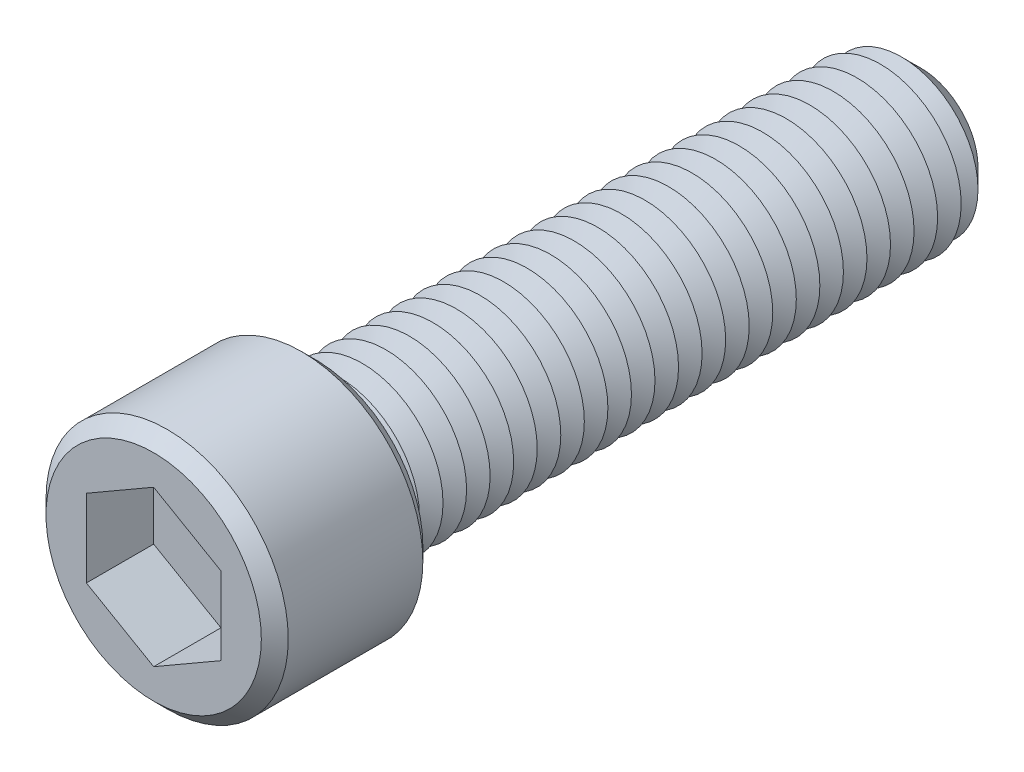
ISO-10303-21;
HEADER;
FILE_DESCRIPTION(('STEP AP214'),'2;1');
FILE_NAME('part.step','',(''),(''),'','','');
FILE_SCHEMA(('AUTOMOTIVE_DESIGN { 1 0 10303 214 1 1 1 1 }'));
ENDSEC;
DATA;
#1=APPLICATION_CONTEXT('core data for automotive mechanical design processes');
#2=APPLICATION_PROTOCOL_DEFINITION('international standard','automotive_design',2000,#1);
#3=PRODUCT_CONTEXT('',#1,'mechanical');
#4=PRODUCT('Part','Part','',(#3));
#5=PRODUCT_RELATED_PRODUCT_CATEGORY('part','',(#4));
#6=PRODUCT_DEFINITION_FORMATION('','',#4);
#7=PRODUCT_DEFINITION_CONTEXT('part definition',#1,'design');
#8=PRODUCT_DEFINITION('design','',#6,#7);
#9=PRODUCT_DEFINITION_SHAPE('','',#8);
#10=(LENGTH_UNIT() NAMED_UNIT(*) SI_UNIT(.MILLI.,.METRE.));
#11=(NAMED_UNIT(*) PLANE_ANGLE_UNIT() SI_UNIT($,.RADIAN.));
#12=(NAMED_UNIT(*) SI_UNIT($,.STERADIAN.) SOLID_ANGLE_UNIT());
#13=UNCERTAINTY_MEASURE_WITH_UNIT(LENGTH_MEASURE(1.E-05),#10,'distance_accuracy_value','');
#14=(GEOMETRIC_REPRESENTATION_CONTEXT(3) GLOBAL_UNCERTAINTY_ASSIGNED_CONTEXT((#13)) GLOBAL_UNIT_ASSIGNED_CONTEXT((#10,
#11,#12)) REPRESENTATION_CONTEXT('',''));
#15=CARTESIAN_POINT('',(0.,0.,0.));
#16=DIRECTION('',(0.,0.,1.));
#17=DIRECTION('',(1.,0.,0.));
#18=AXIS2_PLACEMENT_3D('',#15,#16,#17);
#19=CARTESIAN_POINT('',(0.,0.,12.));
#20=DIRECTION('',(0.,0.,-1.));
#21=DIRECTION('',(-1.,0.,0.));
#22=AXIS2_PLACEMENT_3D('',#19,#20,#21);
#23=CYLINDRICAL_SURFACE('',#22,9.);
#24=CARTESIAN_POINT('',(0.,0.,0.999999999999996));
#25=DIRECTION('',(0.,0.,1.));
#26=DIRECTION('',(1.,0.,0.));
#27=AXIS2_PLACEMENT_3D('',#24,#25,#26);
#28=CIRCLE('',#27,9.);
#29=CARTESIAN_POINT('',(9.,0.,0.999999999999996));
#30=VERTEX_POINT('',#29);
#31=EDGE_CURVE('E376',#30,#30,#28,.T.);
#32=ORIENTED_EDGE('',*,*,#31,.T.);
#33=EDGE_LOOP('',(#32));
#34=FACE_BOUND('',#33,.T.);
#35=CARTESIAN_POINT('',(0.,0.,11.));
#36=DIRECTION('',(0.,0.,1.));
#37=DIRECTION('',(1.,0.,0.));
#38=AXIS2_PLACEMENT_3D('',#35,#36,#37);
#39=CIRCLE('',#38,9.);
#40=CARTESIAN_POINT('',(9.,0.,11.));
#41=VERTEX_POINT('',#40);
#42=EDGE_CURVE('E369',#41,#41,#39,.F.);
#43=ORIENTED_EDGE('',*,*,#42,.T.);
#44=EDGE_LOOP('',(#43));
#45=FACE_BOUND('',#44,.T.);
#46=ADVANCED_FACE('F39',(#34,#45),#23,.T.);
#47=CARTESIAN_POINT('',(0.,0.,12.));
#48=DIRECTION('',(0.,0.,1.));
#49=DIRECTION('',(1.,0.,0.));
#50=AXIS2_PLACEMENT_3D('',#47,#48,#49);
#51=PLANE('',#50);
#52=CARTESIAN_POINT('',(0.,0.,12.));
#53=DIRECTION('',(0.,0.,1.));
#54=DIRECTION('',(1.,0.,0.));
#55=AXIS2_PLACEMENT_3D('',#52,#53,#54);
#56=CIRCLE('',#55,7.99999999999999);
#57=CARTESIAN_POINT('',(7.99999999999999,0.,12.));
#58=VERTEX_POINT('',#57);
#59=EDGE_CURVE('E11',#58,#58,#56,.T.);
#60=ORIENTED_EDGE('',*,*,#59,.T.);
#61=EDGE_LOOP('',(#60));
#62=FACE_BOUND('',#61,.T.);
#63=DIRECTION('',(-0.866025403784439,0.5,0.));
#64=VECTOR('',#63,1.);
#65=CARTESIAN_POINT('',(5.,2.88675134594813,12.));
#66=LINE('',#65,#64);
#67=CARTESIAN_POINT('',(5.,2.88675134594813,12.));
#68=VERTEX_POINT('',#67);
#69=CARTESIAN_POINT('',(0.,5.77350269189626,12.));
#70=VERTEX_POINT('',#69);
#71=EDGE_CURVE('E55',#68,#70,#66,.T.);
#72=ORIENTED_EDGE('',*,*,#71,.F.);
#73=DIRECTION('',(0.,1.,0.));
#74=VECTOR('',#73,1.);
#75=CARTESIAN_POINT('',(5.,-2.88675134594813,12.));
#76=LINE('',#75,#74);
#77=CARTESIAN_POINT('',(5.,-2.88675134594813,12.));
#78=VERTEX_POINT('',#77);
#79=EDGE_CURVE('E151',#78,#68,#76,.T.);
#80=ORIENTED_EDGE('',*,*,#79,.F.);
#81=DIRECTION('',(0.866025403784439,0.5,0.));
#82=VECTOR('',#81,1.);
#83=CARTESIAN_POINT('',(0.,-5.77350269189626,12.));
#84=LINE('',#83,#82);
#85=CARTESIAN_POINT('',(0.,-5.77350269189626,12.));
#86=VERTEX_POINT('',#85);
#87=EDGE_CURVE('E148',#86,#78,#84,.T.);
#88=ORIENTED_EDGE('',*,*,#87,.F.);
#89=DIRECTION('',(0.866025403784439,-0.5,0.));
#90=VECTOR('',#89,1.);
#91=CARTESIAN_POINT('',(-5.,-2.88675134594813,12.));
#92=LINE('',#91,#90);
#93=CARTESIAN_POINT('',(-5.,-2.88675134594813,12.));
#94=VERTEX_POINT('',#93);
#95=EDGE_CURVE('E103',#94,#86,#92,.T.);
#96=ORIENTED_EDGE('',*,*,#95,.F.);
#97=DIRECTION('',(0.,-1.,0.));
#98=VECTOR('',#97,1.);
#99=CARTESIAN_POINT('',(-5.,2.88675134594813,12.));
#100=LINE('',#99,#98);
#101=CARTESIAN_POINT('',(-5.,2.88675134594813,12.));
#102=VERTEX_POINT('',#101);
#103=EDGE_CURVE('E142',#102,#94,#100,.T.);
#104=ORIENTED_EDGE('',*,*,#103,.F.);
#105=DIRECTION('',(-0.866025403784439,-0.5,0.));
#106=VECTOR('',#105,1.);
#107=CARTESIAN_POINT('',(0.,5.77350269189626,12.));
#108=LINE('',#107,#106);
#109=EDGE_CURVE('E137',#70,#102,#108,.T.);
#110=ORIENTED_EDGE('',*,*,#109,.F.);
#111=EDGE_LOOP('',(#72,#80,#88,#96,#104,#110));
#112=FACE_BOUND('',#111,.T.);
#113=ADVANCED_FACE('F394',(#62,#112),#51,.T.);
#114=CARTESIAN_POINT('',(0.,0.,0.));
#115=DIRECTION('',(0.,0.,1.));
#116=DIRECTION('',(1.,0.,0.));
#117=AXIS2_PLACEMENT_3D('',#114,#115,#116);
#118=PLANE('',#117);
#119=CARTESIAN_POINT('',(0.,0.,0.));
#120=DIRECTION('',(0.,0.,1.));
#121=DIRECTION('',(1.,0.,0.));
#122=AXIS2_PLACEMENT_3D('',#119,#120,#121);
#123=CIRCLE('',#122,8.);
#124=CARTESIAN_POINT('',(8.,0.,0.));
#125=VERTEX_POINT('',#124);
#126=EDGE_CURVE('E48',#125,#125,#123,.F.);
#127=ORIENTED_EDGE('',*,*,#126,.T.);
#128=EDGE_LOOP('',(#127));
#129=FACE_BOUND('',#128,.T.);
#130=CARTESIAN_POINT('',(0.,0.,0.));
#131=DIRECTION('',(0.,0.,1.));
#132=DIRECTION('',(1.,0.,0.));
#133=AXIS2_PLACEMENT_3D('',#130,#131,#132);
#134=CIRCLE('',#133,6.);
#135=CARTESIAN_POINT('',(6.,0.,0.));
#136=VERTEX_POINT('',#135);
#137=EDGE_CURVE('E361',#136,#136,#134,.T.);
#138=ORIENTED_EDGE('',*,*,#137,.T.);
#139=EDGE_LOOP('',(#138));
#140=FACE_BOUND('',#139,.T.);
#141=ADVANCED_FACE('F383',(#129,#140),#118,.F.);
#142=CARTESIAN_POINT('',(0.,0.,0.));
#143=DIRECTION('',(0.,0.,1.));
#144=DIRECTION('',(1.,0.,0.));
#145=AXIS2_PLACEMENT_3D('',#142,#143,#144);
#146=CONICAL_SURFACE('',#145,6.,1.0471975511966);
#147=CARTESIAN_POINT('',(0.,0.,-0.875));
#148=DIRECTION('',(0.,0.,1.));
#149=DIRECTION('',(1.,0.,0.));
#150=AXIS2_PLACEMENT_3D('',#147,#148,#149);
#151=CIRCLE('',#150,4.48445554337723);
#152=CARTESIAN_POINT('',(4.48445554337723,0.,-0.875));
#153=VERTEX_POINT('',#152);
#154=EDGE_CURVE('E358',#153,#153,#151,.T.);
#155=ORIENTED_EDGE('',*,*,#154,.T.);
#156=EDGE_LOOP('',(#155));
#157=FACE_BOUND('',#156,.T.);
#158=ORIENTED_EDGE('',*,*,#137,.F.);
#159=EDGE_LOOP('',(#158));
#160=FACE_BOUND('',#159,.T.);
#161=ADVANCED_FACE('F644',(#157,#160),#146,.T.);
#162=CARTESIAN_POINT('',(0.,0.,-0.875));
#163=DIRECTION('',(0.,0.,-1.));
#164=DIRECTION('',(-1.,0.,0.));
#165=AXIS2_PLACEMENT_3D('',#162,#163,#164);
#166=CONICAL_SURFACE('',#165,4.48445554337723,1.0471975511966);
#167=CARTESIAN_POINT('',(0.,0.,-1.75));
#168=DIRECTION('',(0.,0.,1.));
#169=DIRECTION('',(1.,0.,0.));
#170=AXIS2_PLACEMENT_3D('',#167,#168,#169);
#171=CIRCLE('',#170,6.);
#172=CARTESIAN_POINT('',(6.,0.,-1.75));
#173=VERTEX_POINT('',#172);
#174=EDGE_CURVE('E354',#173,#173,#171,.T.);
#175=ORIENTED_EDGE('',*,*,#174,.T.);
#176=EDGE_LOOP('',(#175));
#177=FACE_BOUND('',#176,.T.);
#178=ORIENTED_EDGE('',*,*,#154,.F.);
#179=EDGE_LOOP('',(#178));
#180=FACE_BOUND('',#179,.T.);
#181=ADVANCED_FACE('F640',(#177,#180),#166,.T.);
#182=CARTESIAN_POINT('',(0.,0.,-1.75));
#183=DIRECTION('',(0.,0.,1.));
#184=DIRECTION('',(1.,0.,0.));
#185=AXIS2_PLACEMENT_3D('',#182,#183,#184);
#186=CONICAL_SURFACE('',#185,6.,1.0471975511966);
#187=CARTESIAN_POINT('',(0.,0.,-2.625));
#188=DIRECTION('',(0.,0.,1.));
#189=DIRECTION('',(1.,0.,0.));
#190=AXIS2_PLACEMENT_3D('',#187,#188,#189);
#191=CIRCLE('',#190,4.48445554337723);
#192=CARTESIAN_POINT('',(4.48445554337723,0.,-2.625));
#193=VERTEX_POINT('',#192);
#194=EDGE_CURVE('E350',#193,#193,#191,.T.);
#195=ORIENTED_EDGE('',*,*,#194,.T.);
#196=EDGE_LOOP('',(#195));
#197=FACE_BOUND('',#196,.T.);
#198=ORIENTED_EDGE('',*,*,#174,.F.);
#199=EDGE_LOOP('',(#198));
#200=FACE_BOUND('',#199,.T.);
#201=ADVANCED_FACE('F636',(#197,#200),#186,.T.);
#202=CARTESIAN_POINT('',(0.,0.,-2.625));
#203=DIRECTION('',(0.,0.,-1.));
#204=DIRECTION('',(-1.,0.,0.));
#205=AXIS2_PLACEMENT_3D('',#202,#203,#204);
#206=CONICAL_SURFACE('',#205,4.48445554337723,1.0471975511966);
#207=CARTESIAN_POINT('',(0.,0.,-3.5));
#208=DIRECTION('',(0.,0.,1.));
#209=DIRECTION('',(1.,0.,0.));
#210=AXIS2_PLACEMENT_3D('',#207,#208,#209);
#211=CIRCLE('',#210,6.);
#212=CARTESIAN_POINT('',(6.,0.,-3.5));
#213=VERTEX_POINT('',#212);
#214=EDGE_CURVE('E346',#213,#213,#211,.T.);
#215=ORIENTED_EDGE('',*,*,#214,.T.);
#216=EDGE_LOOP('',(#215));
#217=FACE_BOUND('',#216,.T.);
#218=ORIENTED_EDGE('',*,*,#194,.F.);
#219=EDGE_LOOP('',(#218));
#220=FACE_BOUND('',#219,.T.);
#221=ADVANCED_FACE('F632',(#217,#220),#206,.T.);
#222=CARTESIAN_POINT('',(0.,0.,-3.5));
#223=DIRECTION('',(0.,0.,1.));
#224=DIRECTION('',(1.,0.,0.));
#225=AXIS2_PLACEMENT_3D('',#222,#223,#224);
#226=CONICAL_SURFACE('',#225,6.,1.0471975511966);
#227=CARTESIAN_POINT('',(0.,0.,-4.375));
#228=DIRECTION('',(0.,0.,1.));
#229=DIRECTION('',(1.,0.,0.));
#230=AXIS2_PLACEMENT_3D('',#227,#228,#229);
#231=CIRCLE('',#230,4.48445554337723);
#232=CARTESIAN_POINT('',(4.48445554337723,0.,-4.375));
#233=VERTEX_POINT('',#232);
#234=EDGE_CURVE('E342',#233,#233,#231,.T.);
#235=ORIENTED_EDGE('',*,*,#234,.T.);
#236=EDGE_LOOP('',(#235));
#237=FACE_BOUND('',#236,.T.);
#238=ORIENTED_EDGE('',*,*,#214,.F.);
#239=EDGE_LOOP('',(#238));
#240=FACE_BOUND('',#239,.T.);
#241=ADVANCED_FACE('F628',(#237,#240),#226,.T.);
#242=CARTESIAN_POINT('',(0.,0.,-4.375));
#243=DIRECTION('',(0.,0.,-1.));
#244=DIRECTION('',(-1.,0.,0.));
#245=AXIS2_PLACEMENT_3D('',#242,#243,#244);
#246=CONICAL_SURFACE('',#245,4.48445554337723,1.0471975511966);
#247=CARTESIAN_POINT('',(0.,0.,-5.25));
#248=DIRECTION('',(0.,0.,1.));
#249=DIRECTION('',(1.,0.,0.));
#250=AXIS2_PLACEMENT_3D('',#247,#248,#249);
#251=CIRCLE('',#250,6.);
#252=CARTESIAN_POINT('',(6.,0.,-5.25));
#253=VERTEX_POINT('',#252);
#254=EDGE_CURVE('E338',#253,#253,#251,.T.);
#255=ORIENTED_EDGE('',*,*,#254,.T.);
#256=EDGE_LOOP('',(#255));
#257=FACE_BOUND('',#256,.T.);
#258=ORIENTED_EDGE('',*,*,#234,.F.);
#259=EDGE_LOOP('',(#258));
#260=FACE_BOUND('',#259,.T.);
#261=ADVANCED_FACE('F624',(#257,#260),#246,.T.);
#262=CARTESIAN_POINT('',(0.,0.,-5.25));
#263=DIRECTION('',(0.,0.,1.));
#264=DIRECTION('',(1.,0.,0.));
#265=AXIS2_PLACEMENT_3D('',#262,#263,#264);
#266=CONICAL_SURFACE('',#265,6.,1.0471975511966);
#267=CARTESIAN_POINT('',(0.,0.,-6.125));
#268=DIRECTION('',(0.,0.,1.));
#269=DIRECTION('',(1.,0.,0.));
#270=AXIS2_PLACEMENT_3D('',#267,#268,#269);
#271=CIRCLE('',#270,4.48445554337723);
#272=CARTESIAN_POINT('',(4.48445554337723,0.,-6.125));
#273=VERTEX_POINT('',#272);
#274=EDGE_CURVE('E334',#273,#273,#271,.T.);
#275=ORIENTED_EDGE('',*,*,#274,.T.);
#276=EDGE_LOOP('',(#275));
#277=FACE_BOUND('',#276,.T.);
#278=ORIENTED_EDGE('',*,*,#254,.F.);
#279=EDGE_LOOP('',(#278));
#280=FACE_BOUND('',#279,.T.);
#281=ADVANCED_FACE('F620',(#277,#280),#266,.T.);
#282=CARTESIAN_POINT('',(0.,0.,-6.125));
#283=DIRECTION('',(0.,0.,-1.));
#284=DIRECTION('',(-1.,0.,0.));
#285=AXIS2_PLACEMENT_3D('',#282,#283,#284);
#286=CONICAL_SURFACE('',#285,4.48445554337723,1.0471975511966);
#287=CARTESIAN_POINT('',(0.,0.,-7.));
#288=DIRECTION('',(0.,0.,1.));
#289=DIRECTION('',(1.,0.,0.));
#290=AXIS2_PLACEMENT_3D('',#287,#288,#289);
#291=CIRCLE('',#290,6.);
#292=CARTESIAN_POINT('',(6.,0.,-7.));
#293=VERTEX_POINT('',#292);
#294=EDGE_CURVE('E330',#293,#293,#291,.T.);
#295=ORIENTED_EDGE('',*,*,#294,.T.);
#296=EDGE_LOOP('',(#295));
#297=FACE_BOUND('',#296,.T.);
#298=ORIENTED_EDGE('',*,*,#274,.F.);
#299=EDGE_LOOP('',(#298));
#300=FACE_BOUND('',#299,.T.);
#301=ADVANCED_FACE('F616',(#297,#300),#286,.T.);
#302=CARTESIAN_POINT('',(0.,0.,-7.));
#303=DIRECTION('',(0.,0.,1.));
#304=DIRECTION('',(1.,0.,0.));
#305=AXIS2_PLACEMENT_3D('',#302,#303,#304);
#306=CONICAL_SURFACE('',#305,6.,1.0471975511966);
#307=CARTESIAN_POINT('',(0.,0.,-7.875));
#308=DIRECTION('',(0.,0.,1.));
#309=DIRECTION('',(1.,0.,0.));
#310=AXIS2_PLACEMENT_3D('',#307,#308,#309);
#311=CIRCLE('',#310,4.48445554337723);
#312=CARTESIAN_POINT('',(4.48445554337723,0.,-7.875));
#313=VERTEX_POINT('',#312);
#314=EDGE_CURVE('E326',#313,#313,#311,.T.);
#315=ORIENTED_EDGE('',*,*,#314,.T.);
#316=EDGE_LOOP('',(#315));
#317=FACE_BOUND('',#316,.T.);
#318=ORIENTED_EDGE('',*,*,#294,.F.);
#319=EDGE_LOOP('',(#318));
#320=FACE_BOUND('',#319,.T.);
#321=ADVANCED_FACE('F612',(#317,#320),#306,.T.);
#322=CARTESIAN_POINT('',(0.,0.,-7.875));
#323=DIRECTION('',(0.,0.,-1.));
#324=DIRECTION('',(-1.,0.,0.));
#325=AXIS2_PLACEMENT_3D('',#322,#323,#324);
#326=CONICAL_SURFACE('',#325,4.48445554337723,1.0471975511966);
#327=CARTESIAN_POINT('',(0.,0.,-8.75));
#328=DIRECTION('',(0.,0.,1.));
#329=DIRECTION('',(1.,0.,0.));
#330=AXIS2_PLACEMENT_3D('',#327,#328,#329);
#331=CIRCLE('',#330,6.);
#332=CARTESIAN_POINT('',(6.,0.,-8.75));
#333=VERTEX_POINT('',#332);
#334=EDGE_CURVE('E322',#333,#333,#331,.T.);
#335=ORIENTED_EDGE('',*,*,#334,.T.);
#336=EDGE_LOOP('',(#335));
#337=FACE_BOUND('',#336,.T.);
#338=ORIENTED_EDGE('',*,*,#314,.F.);
#339=EDGE_LOOP('',(#338));
#340=FACE_BOUND('',#339,.T.);
#341=ADVANCED_FACE('F608',(#337,#340),#326,.T.);
#342=CARTESIAN_POINT('',(0.,0.,-8.75));
#343=DIRECTION('',(0.,0.,1.));
#344=DIRECTION('',(1.,0.,0.));
#345=AXIS2_PLACEMENT_3D('',#342,#343,#344);
#346=CONICAL_SURFACE('',#345,6.,1.0471975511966);
#347=CARTESIAN_POINT('',(0.,0.,-9.625));
#348=DIRECTION('',(0.,0.,1.));
#349=DIRECTION('',(1.,0.,0.));
#350=AXIS2_PLACEMENT_3D('',#347,#348,#349);
#351=CIRCLE('',#350,4.48445554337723);
#352=CARTESIAN_POINT('',(4.48445554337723,0.,-9.625));
#353=VERTEX_POINT('',#352);
#354=EDGE_CURVE('E318',#353,#353,#351,.T.);
#355=ORIENTED_EDGE('',*,*,#354,.T.);
#356=EDGE_LOOP('',(#355));
#357=FACE_BOUND('',#356,.T.);
#358=ORIENTED_EDGE('',*,*,#334,.F.);
#359=EDGE_LOOP('',(#358));
#360=FACE_BOUND('',#359,.T.);
#361=ADVANCED_FACE('F604',(#357,#360),#346,.T.);
#362=CARTESIAN_POINT('',(0.,0.,-9.625));
#363=DIRECTION('',(0.,0.,-1.));
#364=DIRECTION('',(-1.,0.,0.));
#365=AXIS2_PLACEMENT_3D('',#362,#363,#364);
#366=CONICAL_SURFACE('',#365,4.48445554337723,1.0471975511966);
#367=CARTESIAN_POINT('',(0.,0.,-10.5));
#368=DIRECTION('',(0.,0.,1.));
#369=DIRECTION('',(1.,0.,0.));
#370=AXIS2_PLACEMENT_3D('',#367,#368,#369);
#371=CIRCLE('',#370,6.);
#372=CARTESIAN_POINT('',(6.,0.,-10.5));
#373=VERTEX_POINT('',#372);
#374=EDGE_CURVE('E314',#373,#373,#371,.T.);
#375=ORIENTED_EDGE('',*,*,#374,.T.);
#376=EDGE_LOOP('',(#375));
#377=FACE_BOUND('',#376,.T.);
#378=ORIENTED_EDGE('',*,*,#354,.F.);
#379=EDGE_LOOP('',(#378));
#380=FACE_BOUND('',#379,.T.);
#381=ADVANCED_FACE('F600',(#377,#380),#366,.T.);
#382=CARTESIAN_POINT('',(0.,0.,-10.5));
#383=DIRECTION('',(0.,0.,1.));
#384=DIRECTION('',(1.,0.,0.));
#385=AXIS2_PLACEMENT_3D('',#382,#383,#384);
#386=CONICAL_SURFACE('',#385,6.,1.0471975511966);
#387=CARTESIAN_POINT('',(0.,0.,-11.375));
#388=DIRECTION('',(0.,0.,1.));
#389=DIRECTION('',(1.,0.,0.));
#390=AXIS2_PLACEMENT_3D('',#387,#388,#389);
#391=CIRCLE('',#390,4.48445554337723);
#392=CARTESIAN_POINT('',(4.48445554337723,0.,-11.375));
#393=VERTEX_POINT('',#392);
#394=EDGE_CURVE('E310',#393,#393,#391,.T.);
#395=ORIENTED_EDGE('',*,*,#394,.T.);
#396=EDGE_LOOP('',(#395));
#397=FACE_BOUND('',#396,.T.);
#398=ORIENTED_EDGE('',*,*,#374,.F.);
#399=EDGE_LOOP('',(#398));
#400=FACE_BOUND('',#399,.T.);
#401=ADVANCED_FACE('F596',(#397,#400),#386,.T.);
#402=CARTESIAN_POINT('',(0.,0.,-11.375));
#403=DIRECTION('',(0.,0.,-1.));
#404=DIRECTION('',(-1.,0.,0.));
#405=AXIS2_PLACEMENT_3D('',#402,#403,#404);
#406=CONICAL_SURFACE('',#405,4.48445554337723,1.0471975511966);
#407=CARTESIAN_POINT('',(0.,0.,-12.25));
#408=DIRECTION('',(0.,0.,1.));
#409=DIRECTION('',(1.,0.,0.));
#410=AXIS2_PLACEMENT_3D('',#407,#408,#409);
#411=CIRCLE('',#410,6.);
#412=CARTESIAN_POINT('',(6.,0.,-12.25));
#413=VERTEX_POINT('',#412);
#414=EDGE_CURVE('E306',#413,#413,#411,.T.);
#415=ORIENTED_EDGE('',*,*,#414,.T.);
#416=EDGE_LOOP('',(#415));
#417=FACE_BOUND('',#416,.T.);
#418=ORIENTED_EDGE('',*,*,#394,.F.);
#419=EDGE_LOOP('',(#418));
#420=FACE_BOUND('',#419,.T.);
#421=ADVANCED_FACE('F592',(#417,#420),#406,.T.);
#422=CARTESIAN_POINT('',(0.,0.,-12.25));
#423=DIRECTION('',(0.,0.,1.));
#424=DIRECTION('',(1.,0.,0.));
#425=AXIS2_PLACEMENT_3D('',#422,#423,#424);
#426=CONICAL_SURFACE('',#425,6.,1.0471975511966);
#427=CARTESIAN_POINT('',(0.,0.,-13.125));
#428=DIRECTION('',(0.,0.,1.));
#429=DIRECTION('',(1.,0.,0.));
#430=AXIS2_PLACEMENT_3D('',#427,#428,#429);
#431=CIRCLE('',#430,4.48445554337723);
#432=CARTESIAN_POINT('',(4.48445554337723,0.,-13.125));
#433=VERTEX_POINT('',#432);
#434=EDGE_CURVE('E302',#433,#433,#431,.T.);
#435=ORIENTED_EDGE('',*,*,#434,.T.);
#436=EDGE_LOOP('',(#435));
#437=FACE_BOUND('',#436,.T.);
#438=ORIENTED_EDGE('',*,*,#414,.F.);
#439=EDGE_LOOP('',(#438));
#440=FACE_BOUND('',#439,.T.);
#441=ADVANCED_FACE('F588',(#437,#440),#426,.T.);
#442=CARTESIAN_POINT('',(0.,0.,-13.125));
#443=DIRECTION('',(0.,0.,-1.));
#444=DIRECTION('',(-1.,0.,0.));
#445=AXIS2_PLACEMENT_3D('',#442,#443,#444);
#446=CONICAL_SURFACE('',#445,4.48445554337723,1.0471975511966);
#447=CARTESIAN_POINT('',(0.,0.,-14.));
#448=DIRECTION('',(0.,0.,1.));
#449=DIRECTION('',(1.,0.,0.));
#450=AXIS2_PLACEMENT_3D('',#447,#448,#449);
#451=CIRCLE('',#450,6.);
#452=CARTESIAN_POINT('',(6.,0.,-14.));
#453=VERTEX_POINT('',#452);
#454=EDGE_CURVE('E298',#453,#453,#451,.T.);
#455=ORIENTED_EDGE('',*,*,#454,.T.);
#456=EDGE_LOOP('',(#455));
#457=FACE_BOUND('',#456,.T.);
#458=ORIENTED_EDGE('',*,*,#434,.F.);
#459=EDGE_LOOP('',(#458));
#460=FACE_BOUND('',#459,.T.);
#461=ADVANCED_FACE('F584',(#457,#460),#446,.T.);
#462=CARTESIAN_POINT('',(0.,0.,-14.));
#463=DIRECTION('',(0.,0.,1.));
#464=DIRECTION('',(1.,0.,0.));
#465=AXIS2_PLACEMENT_3D('',#462,#463,#464);
#466=CONICAL_SURFACE('',#465,6.,1.0471975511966);
#467=CARTESIAN_POINT('',(0.,0.,-14.875));
#468=DIRECTION('',(0.,0.,1.));
#469=DIRECTION('',(1.,0.,0.));
#470=AXIS2_PLACEMENT_3D('',#467,#468,#469);
#471=CIRCLE('',#470,4.48445554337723);
#472=CARTESIAN_POINT('',(4.48445554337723,0.,-14.875));
#473=VERTEX_POINT('',#472);
#474=EDGE_CURVE('E294',#473,#473,#471,.T.);
#475=ORIENTED_EDGE('',*,*,#474,.T.);
#476=EDGE_LOOP('',(#475));
#477=FACE_BOUND('',#476,.T.);
#478=ORIENTED_EDGE('',*,*,#454,.F.);
#479=EDGE_LOOP('',(#478));
#480=FACE_BOUND('',#479,.T.);
#481=ADVANCED_FACE('F580',(#477,#480),#466,.T.);
#482=CARTESIAN_POINT('',(0.,0.,-14.875));
#483=DIRECTION('',(0.,0.,-1.));
#484=DIRECTION('',(-1.,0.,0.));
#485=AXIS2_PLACEMENT_3D('',#482,#483,#484);
#486=CONICAL_SURFACE('',#485,4.48445554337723,1.0471975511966);
#487=CARTESIAN_POINT('',(0.,0.,-15.75));
#488=DIRECTION('',(0.,0.,1.));
#489=DIRECTION('',(1.,0.,0.));
#490=AXIS2_PLACEMENT_3D('',#487,#488,#489);
#491=CIRCLE('',#490,6.);
#492=CARTESIAN_POINT('',(6.,0.,-15.75));
#493=VERTEX_POINT('',#492);
#494=EDGE_CURVE('E290',#493,#493,#491,.T.);
#495=ORIENTED_EDGE('',*,*,#494,.T.);
#496=EDGE_LOOP('',(#495));
#497=FACE_BOUND('',#496,.T.);
#498=ORIENTED_EDGE('',*,*,#474,.F.);
#499=EDGE_LOOP('',(#498));
#500=FACE_BOUND('',#499,.T.);
#501=ADVANCED_FACE('F576',(#497,#500),#486,.T.);
#502=CARTESIAN_POINT('',(0.,0.,-15.75));
#503=DIRECTION('',(0.,0.,1.));
#504=DIRECTION('',(1.,0.,0.));
#505=AXIS2_PLACEMENT_3D('',#502,#503,#504);
#506=CONICAL_SURFACE('',#505,6.,1.0471975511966);
#507=CARTESIAN_POINT('',(0.,0.,-16.625));
#508=DIRECTION('',(0.,0.,1.));
#509=DIRECTION('',(1.,0.,0.));
#510=AXIS2_PLACEMENT_3D('',#507,#508,#509);
#511=CIRCLE('',#510,4.48445554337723);
#512=CARTESIAN_POINT('',(4.48445554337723,0.,-16.625));
#513=VERTEX_POINT('',#512);
#514=EDGE_CURVE('E286',#513,#513,#511,.T.);
#515=ORIENTED_EDGE('',*,*,#514,.T.);
#516=EDGE_LOOP('',(#515));
#517=FACE_BOUND('',#516,.T.);
#518=ORIENTED_EDGE('',*,*,#494,.F.);
#519=EDGE_LOOP('',(#518));
#520=FACE_BOUND('',#519,.T.);
#521=ADVANCED_FACE('F572',(#517,#520),#506,.T.);
#522=CARTESIAN_POINT('',(0.,0.,-16.625));
#523=DIRECTION('',(0.,0.,-1.));
#524=DIRECTION('',(-1.,0.,0.));
#525=AXIS2_PLACEMENT_3D('',#522,#523,#524);
#526=CONICAL_SURFACE('',#525,4.48445554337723,1.0471975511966);
#527=CARTESIAN_POINT('',(0.,0.,-17.5));
#528=DIRECTION('',(0.,0.,1.));
#529=DIRECTION('',(1.,0.,0.));
#530=AXIS2_PLACEMENT_3D('',#527,#528,#529);
#531=CIRCLE('',#530,6.);
#532=CARTESIAN_POINT('',(6.,0.,-17.5));
#533=VERTEX_POINT('',#532);
#534=EDGE_CURVE('E282',#533,#533,#531,.T.);
#535=ORIENTED_EDGE('',*,*,#534,.T.);
#536=EDGE_LOOP('',(#535));
#537=FACE_BOUND('',#536,.T.);
#538=ORIENTED_EDGE('',*,*,#514,.F.);
#539=EDGE_LOOP('',(#538));
#540=FACE_BOUND('',#539,.T.);
#541=ADVANCED_FACE('F568',(#537,#540),#526,.T.);
#542=CARTESIAN_POINT('',(0.,0.,-17.5));
#543=DIRECTION('',(0.,0.,1.));
#544=DIRECTION('',(1.,0.,0.));
#545=AXIS2_PLACEMENT_3D('',#542,#543,#544);
#546=CONICAL_SURFACE('',#545,6.,1.0471975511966);
#547=CARTESIAN_POINT('',(0.,0.,-18.375));
#548=DIRECTION('',(0.,0.,1.));
#549=DIRECTION('',(1.,0.,0.));
#550=AXIS2_PLACEMENT_3D('',#547,#548,#549);
#551=CIRCLE('',#550,4.48445554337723);
#552=CARTESIAN_POINT('',(4.48445554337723,0.,-18.375));
#553=VERTEX_POINT('',#552);
#554=EDGE_CURVE('E278',#553,#553,#551,.T.);
#555=ORIENTED_EDGE('',*,*,#554,.T.);
#556=EDGE_LOOP('',(#555));
#557=FACE_BOUND('',#556,.T.);
#558=ORIENTED_EDGE('',*,*,#534,.F.);
#559=EDGE_LOOP('',(#558));
#560=FACE_BOUND('',#559,.T.);
#561=ADVANCED_FACE('F564',(#557,#560),#546,.T.);
#562=CARTESIAN_POINT('',(0.,0.,-18.375));
#563=DIRECTION('',(0.,0.,-1.));
#564=DIRECTION('',(-1.,0.,0.));
#565=AXIS2_PLACEMENT_3D('',#562,#563,#564);
#566=CONICAL_SURFACE('',#565,4.48445554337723,1.0471975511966);
#567=CARTESIAN_POINT('',(0.,0.,-19.25));
#568=DIRECTION('',(0.,0.,1.));
#569=DIRECTION('',(1.,0.,0.));
#570=AXIS2_PLACEMENT_3D('',#567,#568,#569);
#571=CIRCLE('',#570,6.);
#572=CARTESIAN_POINT('',(6.,0.,-19.25));
#573=VERTEX_POINT('',#572);
#574=EDGE_CURVE('E274',#573,#573,#571,.T.);
#575=ORIENTED_EDGE('',*,*,#574,.T.);
#576=EDGE_LOOP('',(#575));
#577=FACE_BOUND('',#576,.T.);
#578=ORIENTED_EDGE('',*,*,#554,.F.);
#579=EDGE_LOOP('',(#578));
#580=FACE_BOUND('',#579,.T.);
#581=ADVANCED_FACE('F560',(#577,#580),#566,.T.);
#582=CARTESIAN_POINT('',(0.,0.,-19.25));
#583=DIRECTION('',(0.,0.,1.));
#584=DIRECTION('',(1.,0.,0.));
#585=AXIS2_PLACEMENT_3D('',#582,#583,#584);
#586=CONICAL_SURFACE('',#585,6.,1.0471975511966);
#587=CARTESIAN_POINT('',(0.,0.,-20.125));
#588=DIRECTION('',(0.,0.,1.));
#589=DIRECTION('',(1.,0.,0.));
#590=AXIS2_PLACEMENT_3D('',#587,#588,#589);
#591=CIRCLE('',#590,4.48445554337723);
#592=CARTESIAN_POINT('',(4.48445554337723,0.,-20.125));
#593=VERTEX_POINT('',#592);
#594=EDGE_CURVE('E270',#593,#593,#591,.T.);
#595=ORIENTED_EDGE('',*,*,#594,.T.);
#596=EDGE_LOOP('',(#595));
#597=FACE_BOUND('',#596,.T.);
#598=ORIENTED_EDGE('',*,*,#574,.F.);
#599=EDGE_LOOP('',(#598));
#600=FACE_BOUND('',#599,.T.);
#601=ADVANCED_FACE('F556',(#597,#600),#586,.T.);
#602=CARTESIAN_POINT('',(0.,0.,-20.125));
#603=DIRECTION('',(0.,0.,-1.));
#604=DIRECTION('',(-1.,0.,0.));
#605=AXIS2_PLACEMENT_3D('',#602,#603,#604);
#606=CONICAL_SURFACE('',#605,4.48445554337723,1.0471975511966);
#607=CARTESIAN_POINT('',(0.,0.,-21.));
#608=DIRECTION('',(0.,0.,1.));
#609=DIRECTION('',(1.,0.,0.));
#610=AXIS2_PLACEMENT_3D('',#607,#608,#609);
#611=CIRCLE('',#610,6.);
#612=CARTESIAN_POINT('',(6.,0.,-21.));
#613=VERTEX_POINT('',#612);
#614=EDGE_CURVE('E266',#613,#613,#611,.T.);
#615=ORIENTED_EDGE('',*,*,#614,.T.);
#616=EDGE_LOOP('',(#615));
#617=FACE_BOUND('',#616,.T.);
#618=ORIENTED_EDGE('',*,*,#594,.F.);
#619=EDGE_LOOP('',(#618));
#620=FACE_BOUND('',#619,.T.);
#621=ADVANCED_FACE('F552',(#617,#620),#606,.T.);
#622=CARTESIAN_POINT('',(0.,0.,-21.));
#623=DIRECTION('',(0.,0.,1.));
#624=DIRECTION('',(1.,0.,0.));
#625=AXIS2_PLACEMENT_3D('',#622,#623,#624);
#626=CONICAL_SURFACE('',#625,6.,1.0471975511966);
#627=CARTESIAN_POINT('',(0.,0.,-21.875));
#628=DIRECTION('',(0.,0.,1.));
#629=DIRECTION('',(1.,0.,0.));
#630=AXIS2_PLACEMENT_3D('',#627,#628,#629);
#631=CIRCLE('',#630,4.48445554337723);
#632=CARTESIAN_POINT('',(4.48445554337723,0.,-21.875));
#633=VERTEX_POINT('',#632);
#634=EDGE_CURVE('E262',#633,#633,#631,.T.);
#635=ORIENTED_EDGE('',*,*,#634,.T.);
#636=EDGE_LOOP('',(#635));
#637=FACE_BOUND('',#636,.T.);
#638=ORIENTED_EDGE('',*,*,#614,.F.);
#639=EDGE_LOOP('',(#638));
#640=FACE_BOUND('',#639,.T.);
#641=ADVANCED_FACE('F548',(#637,#640),#626,.T.);
#642=CARTESIAN_POINT('',(0.,0.,-21.875));
#643=DIRECTION('',(0.,0.,-1.));
#644=DIRECTION('',(-1.,0.,0.));
#645=AXIS2_PLACEMENT_3D('',#642,#643,#644);
#646=CONICAL_SURFACE('',#645,4.48445554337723,1.0471975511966);
#647=CARTESIAN_POINT('',(0.,0.,-22.75));
#648=DIRECTION('',(0.,0.,1.));
#649=DIRECTION('',(1.,0.,0.));
#650=AXIS2_PLACEMENT_3D('',#647,#648,#649);
#651=CIRCLE('',#650,6.);
#652=CARTESIAN_POINT('',(6.,0.,-22.75));
#653=VERTEX_POINT('',#652);
#654=EDGE_CURVE('E258',#653,#653,#651,.T.);
#655=ORIENTED_EDGE('',*,*,#654,.T.);
#656=EDGE_LOOP('',(#655));
#657=FACE_BOUND('',#656,.T.);
#658=ORIENTED_EDGE('',*,*,#634,.F.);
#659=EDGE_LOOP('',(#658));
#660=FACE_BOUND('',#659,.T.);
#661=ADVANCED_FACE('F544',(#657,#660),#646,.T.);
#662=CARTESIAN_POINT('',(0.,0.,-22.75));
#663=DIRECTION('',(0.,0.,1.));
#664=DIRECTION('',(1.,0.,0.));
#665=AXIS2_PLACEMENT_3D('',#662,#663,#664);
#666=CONICAL_SURFACE('',#665,6.,1.0471975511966);
#667=CARTESIAN_POINT('',(0.,0.,-23.625));
#668=DIRECTION('',(0.,0.,1.));
#669=DIRECTION('',(1.,0.,0.));
#670=AXIS2_PLACEMENT_3D('',#667,#668,#669);
#671=CIRCLE('',#670,4.48445554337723);
#672=CARTESIAN_POINT('',(4.48445554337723,0.,-23.625));
#673=VERTEX_POINT('',#672);
#674=EDGE_CURVE('E254',#673,#673,#671,.T.);
#675=ORIENTED_EDGE('',*,*,#674,.T.);
#676=EDGE_LOOP('',(#675));
#677=FACE_BOUND('',#676,.T.);
#678=ORIENTED_EDGE('',*,*,#654,.F.);
#679=EDGE_LOOP('',(#678));
#680=FACE_BOUND('',#679,.T.);
#681=ADVANCED_FACE('F540',(#677,#680),#666,.T.);
#682=CARTESIAN_POINT('',(0.,0.,-23.625));
#683=DIRECTION('',(0.,0.,-1.));
#684=DIRECTION('',(-1.,0.,0.));
#685=AXIS2_PLACEMENT_3D('',#682,#683,#684);
#686=CONICAL_SURFACE('',#685,4.48445554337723,1.0471975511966);
#687=CARTESIAN_POINT('',(0.,0.,-24.5));
#688=DIRECTION('',(0.,0.,1.));
#689=DIRECTION('',(1.,0.,0.));
#690=AXIS2_PLACEMENT_3D('',#687,#688,#689);
#691=CIRCLE('',#690,6.);
#692=CARTESIAN_POINT('',(6.,0.,-24.5));
#693=VERTEX_POINT('',#692);
#694=EDGE_CURVE('E250',#693,#693,#691,.T.);
#695=ORIENTED_EDGE('',*,*,#694,.T.);
#696=EDGE_LOOP('',(#695));
#697=FACE_BOUND('',#696,.T.);
#698=ORIENTED_EDGE('',*,*,#674,.F.);
#699=EDGE_LOOP('',(#698));
#700=FACE_BOUND('',#699,.T.);
#701=ADVANCED_FACE('F536',(#697,#700),#686,.T.);
#702=CARTESIAN_POINT('',(0.,0.,-24.5));
#703=DIRECTION('',(0.,0.,1.));
#704=DIRECTION('',(1.,0.,0.));
#705=AXIS2_PLACEMENT_3D('',#702,#703,#704);
#706=CONICAL_SURFACE('',#705,6.,1.0471975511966);
#707=CARTESIAN_POINT('',(0.,0.,-25.375));
#708=DIRECTION('',(0.,0.,1.));
#709=DIRECTION('',(1.,0.,0.));
#710=AXIS2_PLACEMENT_3D('',#707,#708,#709);
#711=CIRCLE('',#710,4.48445554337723);
#712=CARTESIAN_POINT('',(4.48445554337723,0.,-25.375));
#713=VERTEX_POINT('',#712);
#714=EDGE_CURVE('E246',#713,#713,#711,.T.);
#715=ORIENTED_EDGE('',*,*,#714,.T.);
#716=EDGE_LOOP('',(#715));
#717=FACE_BOUND('',#716,.T.);
#718=ORIENTED_EDGE('',*,*,#694,.F.);
#719=EDGE_LOOP('',(#718));
#720=FACE_BOUND('',#719,.T.);
#721=ADVANCED_FACE('F532',(#717,#720),#706,.T.);
#722=CARTESIAN_POINT('',(0.,0.,-25.375));
#723=DIRECTION('',(0.,0.,-1.));
#724=DIRECTION('',(-1.,0.,0.));
#725=AXIS2_PLACEMENT_3D('',#722,#723,#724);
#726=CONICAL_SURFACE('',#725,4.48445554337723,1.0471975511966);
#727=CARTESIAN_POINT('',(0.,0.,-26.25));
#728=DIRECTION('',(0.,0.,1.));
#729=DIRECTION('',(1.,0.,0.));
#730=AXIS2_PLACEMENT_3D('',#727,#728,#729);
#731=CIRCLE('',#730,6.);
#732=CARTESIAN_POINT('',(6.,0.,-26.25));
#733=VERTEX_POINT('',#732);
#734=EDGE_CURVE('E242',#733,#733,#731,.T.);
#735=ORIENTED_EDGE('',*,*,#734,.T.);
#736=EDGE_LOOP('',(#735));
#737=FACE_BOUND('',#736,.T.);
#738=ORIENTED_EDGE('',*,*,#714,.F.);
#739=EDGE_LOOP('',(#738));
#740=FACE_BOUND('',#739,.T.);
#741=ADVANCED_FACE('F528',(#737,#740),#726,.T.);
#742=CARTESIAN_POINT('',(0.,0.,-26.25));
#743=DIRECTION('',(0.,0.,1.));
#744=DIRECTION('',(1.,0.,0.));
#745=AXIS2_PLACEMENT_3D('',#742,#743,#744);
#746=CONICAL_SURFACE('',#745,6.,1.0471975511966);
#747=CARTESIAN_POINT('',(0.,0.,-27.125));
#748=DIRECTION('',(0.,0.,1.));
#749=DIRECTION('',(1.,0.,0.));
#750=AXIS2_PLACEMENT_3D('',#747,#748,#749);
#751=CIRCLE('',#750,4.48445554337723);
#752=CARTESIAN_POINT('',(4.48445554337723,0.,-27.125));
#753=VERTEX_POINT('',#752);
#754=EDGE_CURVE('E238',#753,#753,#751,.T.);
#755=ORIENTED_EDGE('',*,*,#754,.T.);
#756=EDGE_LOOP('',(#755));
#757=FACE_BOUND('',#756,.T.);
#758=ORIENTED_EDGE('',*,*,#734,.F.);
#759=EDGE_LOOP('',(#758));
#760=FACE_BOUND('',#759,.T.);
#761=ADVANCED_FACE('F524',(#757,#760),#746,.T.);
#762=CARTESIAN_POINT('',(0.,0.,-27.125));
#763=DIRECTION('',(0.,0.,-1.));
#764=DIRECTION('',(-1.,0.,0.));
#765=AXIS2_PLACEMENT_3D('',#762,#763,#764);
#766=CONICAL_SURFACE('',#765,4.48445554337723,1.0471975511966);
#767=CARTESIAN_POINT('',(0.,0.,-28.));
#768=DIRECTION('',(0.,0.,1.));
#769=DIRECTION('',(1.,0.,0.));
#770=AXIS2_PLACEMENT_3D('',#767,#768,#769);
#771=CIRCLE('',#770,6.);
#772=CARTESIAN_POINT('',(6.,0.,-28.));
#773=VERTEX_POINT('',#772);
#774=EDGE_CURVE('E234',#773,#773,#771,.T.);
#775=ORIENTED_EDGE('',*,*,#774,.T.);
#776=EDGE_LOOP('',(#775));
#777=FACE_BOUND('',#776,.T.);
#778=ORIENTED_EDGE('',*,*,#754,.F.);
#779=EDGE_LOOP('',(#778));
#780=FACE_BOUND('',#779,.T.);
#781=ADVANCED_FACE('F520',(#777,#780),#766,.T.);
#782=CARTESIAN_POINT('',(0.,0.,-28.));
#783=DIRECTION('',(0.,0.,1.));
#784=DIRECTION('',(1.,0.,0.));
#785=AXIS2_PLACEMENT_3D('',#782,#783,#784);
#786=CONICAL_SURFACE('',#785,6.,1.0471975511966);
#787=CARTESIAN_POINT('',(0.,0.,-28.875));
#788=DIRECTION('',(0.,0.,1.));
#789=DIRECTION('',(1.,0.,0.));
#790=AXIS2_PLACEMENT_3D('',#787,#788,#789);
#791=CIRCLE('',#790,4.48445554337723);
#792=CARTESIAN_POINT('',(4.48445554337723,0.,-28.875));
#793=VERTEX_POINT('',#792);
#794=EDGE_CURVE('E230',#793,#793,#791,.T.);
#795=ORIENTED_EDGE('',*,*,#794,.T.);
#796=EDGE_LOOP('',(#795));
#797=FACE_BOUND('',#796,.T.);
#798=ORIENTED_EDGE('',*,*,#774,.F.);
#799=EDGE_LOOP('',(#798));
#800=FACE_BOUND('',#799,.T.);
#801=ADVANCED_FACE('F516',(#797,#800),#786,.T.);
#802=CARTESIAN_POINT('',(0.,0.,-28.875));
#803=DIRECTION('',(0.,0.,-1.));
#804=DIRECTION('',(-1.,0.,0.));
#805=AXIS2_PLACEMENT_3D('',#802,#803,#804);
#806=CONICAL_SURFACE('',#805,4.48445554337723,1.0471975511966);
#807=CARTESIAN_POINT('',(0.,0.,-29.75));
#808=DIRECTION('',(0.,0.,1.));
#809=DIRECTION('',(1.,0.,0.));
#810=AXIS2_PLACEMENT_3D('',#807,#808,#809);
#811=CIRCLE('',#810,6.);
#812=CARTESIAN_POINT('',(6.,0.,-29.75));
#813=VERTEX_POINT('',#812);
#814=EDGE_CURVE('E226',#813,#813,#811,.T.);
#815=ORIENTED_EDGE('',*,*,#814,.T.);
#816=EDGE_LOOP('',(#815));
#817=FACE_BOUND('',#816,.T.);
#818=ORIENTED_EDGE('',*,*,#794,.F.);
#819=EDGE_LOOP('',(#818));
#820=FACE_BOUND('',#819,.T.);
#821=ADVANCED_FACE('F512',(#817,#820),#806,.T.);
#822=CARTESIAN_POINT('',(0.,0.,-29.75));
#823=DIRECTION('',(0.,0.,1.));
#824=DIRECTION('',(1.,0.,0.));
#825=AXIS2_PLACEMENT_3D('',#822,#823,#824);
#826=CONICAL_SURFACE('',#825,6.,1.0471975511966);
#827=CARTESIAN_POINT('',(0.,0.,-30.625));
#828=DIRECTION('',(0.,0.,1.));
#829=DIRECTION('',(1.,0.,0.));
#830=AXIS2_PLACEMENT_3D('',#827,#828,#829);
#831=CIRCLE('',#830,4.48445554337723);
#832=CARTESIAN_POINT('',(4.48445554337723,0.,-30.625));
#833=VERTEX_POINT('',#832);
#834=EDGE_CURVE('E222',#833,#833,#831,.T.);
#835=ORIENTED_EDGE('',*,*,#834,.T.);
#836=EDGE_LOOP('',(#835));
#837=FACE_BOUND('',#836,.T.);
#838=ORIENTED_EDGE('',*,*,#814,.F.);
#839=EDGE_LOOP('',(#838));
#840=FACE_BOUND('',#839,.T.);
#841=ADVANCED_FACE('F508',(#837,#840),#826,.T.);
#842=CARTESIAN_POINT('',(0.,0.,-30.625));
#843=DIRECTION('',(0.,0.,-1.));
#844=DIRECTION('',(-1.,0.,0.));
#845=AXIS2_PLACEMENT_3D('',#842,#843,#844);
#846=CONICAL_SURFACE('',#845,4.48445554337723,1.0471975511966);
#847=CARTESIAN_POINT('',(0.,0.,-31.5));
#848=DIRECTION('',(0.,0.,1.));
#849=DIRECTION('',(1.,0.,0.));
#850=AXIS2_PLACEMENT_3D('',#847,#848,#849);
#851=CIRCLE('',#850,6.);
#852=CARTESIAN_POINT('',(6.,0.,-31.5));
#853=VERTEX_POINT('',#852);
#854=EDGE_CURVE('E218',#853,#853,#851,.T.);
#855=ORIENTED_EDGE('',*,*,#854,.T.);
#856=EDGE_LOOP('',(#855));
#857=FACE_BOUND('',#856,.T.);
#858=ORIENTED_EDGE('',*,*,#834,.F.);
#859=EDGE_LOOP('',(#858));
#860=FACE_BOUND('',#859,.T.);
#861=ADVANCED_FACE('F504',(#857,#860),#846,.T.);
#862=CARTESIAN_POINT('',(0.,0.,-31.5));
#863=DIRECTION('',(0.,0.,1.));
#864=DIRECTION('',(1.,0.,0.));
#865=AXIS2_PLACEMENT_3D('',#862,#863,#864);
#866=CONICAL_SURFACE('',#865,6.,1.0471975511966);
#867=CARTESIAN_POINT('',(0.,0.,-32.375));
#868=DIRECTION('',(0.,0.,1.));
#869=DIRECTION('',(1.,0.,0.));
#870=AXIS2_PLACEMENT_3D('',#867,#868,#869);
#871=CIRCLE('',#870,4.48445554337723);
#872=CARTESIAN_POINT('',(4.48445554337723,0.,-32.375));
#873=VERTEX_POINT('',#872);
#874=EDGE_CURVE('E214',#873,#873,#871,.T.);
#875=ORIENTED_EDGE('',*,*,#874,.T.);
#876=EDGE_LOOP('',(#875));
#877=FACE_BOUND('',#876,.T.);
#878=ORIENTED_EDGE('',*,*,#854,.F.);
#879=EDGE_LOOP('',(#878));
#880=FACE_BOUND('',#879,.T.);
#881=ADVANCED_FACE('F500',(#877,#880),#866,.T.);
#882=CARTESIAN_POINT('',(0.,0.,-32.375));
#883=DIRECTION('',(0.,0.,-1.));
#884=DIRECTION('',(-1.,0.,0.));
#885=AXIS2_PLACEMENT_3D('',#882,#883,#884);
#886=CONICAL_SURFACE('',#885,4.48445554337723,1.0471975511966);
#887=CARTESIAN_POINT('',(0.,0.,-33.25));
#888=DIRECTION('',(0.,0.,1.));
#889=DIRECTION('',(1.,0.,0.));
#890=AXIS2_PLACEMENT_3D('',#887,#888,#889);
#891=CIRCLE('',#890,6.);
#892=CARTESIAN_POINT('',(6.,0.,-33.25));
#893=VERTEX_POINT('',#892);
#894=EDGE_CURVE('E210',#893,#893,#891,.T.);
#895=ORIENTED_EDGE('',*,*,#894,.T.);
#896=EDGE_LOOP('',(#895));
#897=FACE_BOUND('',#896,.T.);
#898=ORIENTED_EDGE('',*,*,#874,.F.);
#899=EDGE_LOOP('',(#898));
#900=FACE_BOUND('',#899,.T.);
#901=ADVANCED_FACE('F496',(#897,#900),#886,.T.);
#902=CARTESIAN_POINT('',(0.,0.,-33.25));
#903=DIRECTION('',(0.,0.,1.));
#904=DIRECTION('',(1.,0.,0.));
#905=AXIS2_PLACEMENT_3D('',#902,#903,#904);
#906=CONICAL_SURFACE('',#905,6.,1.0471975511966);
#907=CARTESIAN_POINT('',(0.,0.,-34.125));
#908=DIRECTION('',(0.,0.,1.));
#909=DIRECTION('',(1.,0.,0.));
#910=AXIS2_PLACEMENT_3D('',#907,#908,#909);
#911=CIRCLE('',#910,4.48445554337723);
#912=CARTESIAN_POINT('',(4.48445554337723,0.,-34.125));
#913=VERTEX_POINT('',#912);
#914=EDGE_CURVE('E206',#913,#913,#911,.T.);
#915=ORIENTED_EDGE('',*,*,#914,.T.);
#916=EDGE_LOOP('',(#915));
#917=FACE_BOUND('',#916,.T.);
#918=ORIENTED_EDGE('',*,*,#894,.F.);
#919=EDGE_LOOP('',(#918));
#920=FACE_BOUND('',#919,.T.);
#921=ADVANCED_FACE('F492',(#917,#920),#906,.T.);
#922=CARTESIAN_POINT('',(0.,0.,-34.125));
#923=DIRECTION('',(0.,0.,-1.));
#924=DIRECTION('',(-1.,0.,0.));
#925=AXIS2_PLACEMENT_3D('',#922,#923,#924);
#926=CONICAL_SURFACE('',#925,4.48445554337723,1.0471975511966);
#927=CARTESIAN_POINT('',(0.,0.,-35.));
#928=DIRECTION('',(0.,0.,1.));
#929=DIRECTION('',(1.,0.,0.));
#930=AXIS2_PLACEMENT_3D('',#927,#928,#929);
#931=CIRCLE('',#930,6.);
#932=CARTESIAN_POINT('',(6.,0.,-35.));
#933=VERTEX_POINT('',#932);
#934=EDGE_CURVE('E203',#933,#933,#931,.T.);
#935=ORIENTED_EDGE('',*,*,#934,.T.);
#936=EDGE_LOOP('',(#935));
#937=FACE_BOUND('',#936,.T.);
#938=ORIENTED_EDGE('',*,*,#914,.F.);
#939=EDGE_LOOP('',(#938));
#940=FACE_BOUND('',#939,.T.);
#941=ADVANCED_FACE('F488',(#937,#940),#926,.T.);
#942=CARTESIAN_POINT('',(0.,0.,-35.));
#943=DIRECTION('',(0.,0.,1.));
#944=DIRECTION('',(1.,0.,0.));
#945=AXIS2_PLACEMENT_3D('',#942,#943,#944);
#946=CONICAL_SURFACE('',#945,6.,1.0471975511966);
#947=CARTESIAN_POINT('',(0.,0.,-35.875));
#948=DIRECTION('',(0.,0.,1.));
#949=DIRECTION('',(1.,0.,0.));
#950=AXIS2_PLACEMENT_3D('',#947,#948,#949);
#951=CIRCLE('',#950,4.48445554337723);
#952=CARTESIAN_POINT('',(4.48445554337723,0.,-35.875));
#953=VERTEX_POINT('',#952);
#954=EDGE_CURVE('E199',#953,#953,#951,.T.);
#955=ORIENTED_EDGE('',*,*,#954,.T.);
#956=EDGE_LOOP('',(#955));
#957=FACE_BOUND('',#956,.T.);
#958=ORIENTED_EDGE('',*,*,#934,.F.);
#959=EDGE_LOOP('',(#958));
#960=FACE_BOUND('',#959,.T.);
#961=ADVANCED_FACE('F484',(#957,#960),#946,.T.);
#962=CARTESIAN_POINT('',(0.,0.,-35.875));
#963=DIRECTION('',(0.,0.,-1.));
#964=DIRECTION('',(-1.,0.,0.));
#965=AXIS2_PLACEMENT_3D('',#962,#963,#964);
#966=CONICAL_SURFACE('',#965,4.48445554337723,1.0471975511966);
#967=CARTESIAN_POINT('',(0.,0.,-36.75));
#968=DIRECTION('',(0.,0.,1.));
#969=DIRECTION('',(1.,0.,0.));
#970=AXIS2_PLACEMENT_3D('',#967,#968,#969);
#971=CIRCLE('',#970,6.);
#972=CARTESIAN_POINT('',(6.,0.,-36.75));
#973=VERTEX_POINT('',#972);
#974=EDGE_CURVE('E195',#973,#973,#971,.T.);
#975=ORIENTED_EDGE('',*,*,#974,.T.);
#976=EDGE_LOOP('',(#975));
#977=FACE_BOUND('',#976,.T.);
#978=ORIENTED_EDGE('',*,*,#954,.F.);
#979=EDGE_LOOP('',(#978));
#980=FACE_BOUND('',#979,.T.);
#981=ADVANCED_FACE('F480',(#977,#980),#966,.T.);
#982=CARTESIAN_POINT('',(0.,0.,-36.75));
#983=DIRECTION('',(0.,0.,1.));
#984=DIRECTION('',(1.,0.,0.));
#985=AXIS2_PLACEMENT_3D('',#982,#983,#984);
#986=CONICAL_SURFACE('',#985,6.,1.0471975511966);
#987=CARTESIAN_POINT('',(0.,0.,-37.625));
#988=DIRECTION('',(0.,0.,1.));
#989=DIRECTION('',(1.,0.,0.));
#990=AXIS2_PLACEMENT_3D('',#987,#988,#989);
#991=CIRCLE('',#990,4.48445554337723);
#992=CARTESIAN_POINT('',(4.48445554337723,0.,-37.625));
#993=VERTEX_POINT('',#992);
#994=EDGE_CURVE('E191',#993,#993,#991,.T.);
#995=ORIENTED_EDGE('',*,*,#994,.T.);
#996=EDGE_LOOP('',(#995));
#997=FACE_BOUND('',#996,.T.);
#998=ORIENTED_EDGE('',*,*,#974,.F.);
#999=EDGE_LOOP('',(#998));
#1000=FACE_BOUND('',#999,.T.);
#1001=ADVANCED_FACE('F476',(#997,#1000),#986,.T.);
#1002=CARTESIAN_POINT('',(0.,0.,-37.625));
#1003=DIRECTION('',(0.,0.,-1.));
#1004=DIRECTION('',(-1.,0.,0.));
#1005=AXIS2_PLACEMENT_3D('',#1002,#1003,#1004);
#1006=CONICAL_SURFACE('',#1005,4.48445554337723,1.0471975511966);
#1007=CARTESIAN_POINT('',(0.,0.,-38.5));
#1008=DIRECTION('',(0.,0.,1.));
#1009=DIRECTION('',(1.,0.,0.));
#1010=AXIS2_PLACEMENT_3D('',#1007,#1008,#1009);
#1011=CIRCLE('',#1010,6.);
#1012=CARTESIAN_POINT('',(6.,0.,-38.5));
#1013=VERTEX_POINT('',#1012);
#1014=EDGE_CURVE('E187',#1013,#1013,#1011,.T.);
#1015=ORIENTED_EDGE('',*,*,#1014,.T.);
#1016=EDGE_LOOP('',(#1015));
#1017=FACE_BOUND('',#1016,.T.);
#1018=ORIENTED_EDGE('',*,*,#994,.F.);
#1019=EDGE_LOOP('',(#1018));
#1020=FACE_BOUND('',#1019,.T.);
#1021=ADVANCED_FACE('F472',(#1017,#1020),#1006,.T.);
#1022=CARTESIAN_POINT('',(0.,0.,-38.5));
#1023=DIRECTION('',(0.,0.,1.));
#1024=DIRECTION('',(1.,0.,0.));
#1025=AXIS2_PLACEMENT_3D('',#1022,#1023,#1024);
#1026=CONICAL_SURFACE('',#1025,6.,1.0471975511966);
#1027=CARTESIAN_POINT('',(0.,0.,-39.375));
#1028=DIRECTION('',(0.,0.,1.));
#1029=DIRECTION('',(1.,0.,0.));
#1030=AXIS2_PLACEMENT_3D('',#1027,#1028,#1029);
#1031=CIRCLE('',#1030,4.48445554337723);
#1032=CARTESIAN_POINT('',(4.48445554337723,0.,-39.375));
#1033=VERTEX_POINT('',#1032);
#1034=EDGE_CURVE('E183',#1033,#1033,#1031,.T.);
#1035=ORIENTED_EDGE('',*,*,#1034,.T.);
#1036=EDGE_LOOP('',(#1035));
#1037=FACE_BOUND('',#1036,.T.);
#1038=ORIENTED_EDGE('',*,*,#1014,.F.);
#1039=EDGE_LOOP('',(#1038));
#1040=FACE_BOUND('',#1039,.T.);
#1041=ADVANCED_FACE('F468',(#1037,#1040),#1026,.T.);
#1042=CARTESIAN_POINT('',(0.,0.,-39.375));
#1043=DIRECTION('',(0.,0.,-1.));
#1044=DIRECTION('',(-1.,0.,0.));
#1045=AXIS2_PLACEMENT_3D('',#1042,#1043,#1044);
#1046=CONICAL_SURFACE('',#1045,4.48445554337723,1.0471975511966);
#1047=CARTESIAN_POINT('',(0.,0.,-40.25));
#1048=DIRECTION('',(0.,0.,1.));
#1049=DIRECTION('',(1.,0.,0.));
#1050=AXIS2_PLACEMENT_3D('',#1047,#1048,#1049);
#1051=CIRCLE('',#1050,6.);
#1052=CARTESIAN_POINT('',(6.,0.,-40.25));
#1053=VERTEX_POINT('',#1052);
#1054=EDGE_CURVE('E179',#1053,#1053,#1051,.T.);
#1055=ORIENTED_EDGE('',*,*,#1054,.T.);
#1056=EDGE_LOOP('',(#1055));
#1057=FACE_BOUND('',#1056,.T.);
#1058=ORIENTED_EDGE('',*,*,#1034,.F.);
#1059=EDGE_LOOP('',(#1058));
#1060=FACE_BOUND('',#1059,.T.);
#1061=ADVANCED_FACE('F464',(#1057,#1060),#1046,.T.);
#1062=CARTESIAN_POINT('',(0.,0.,-40.25));
#1063=DIRECTION('',(0.,0.,1.));
#1064=DIRECTION('',(1.,0.,0.));
#1065=AXIS2_PLACEMENT_3D('',#1062,#1063,#1064);
#1066=CONICAL_SURFACE('',#1065,6.,1.0471975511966);
#1067=CARTESIAN_POINT('',(0.,0.,-41.125));
#1068=DIRECTION('',(0.,0.,1.));
#1069=DIRECTION('',(1.,0.,0.));
#1070=AXIS2_PLACEMENT_3D('',#1067,#1068,#1069);
#1071=CIRCLE('',#1070,4.48445554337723);
#1072=CARTESIAN_POINT('',(4.48445554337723,0.,-41.125));
#1073=VERTEX_POINT('',#1072);
#1074=EDGE_CURVE('E175',#1073,#1073,#1071,.T.);
#1075=ORIENTED_EDGE('',*,*,#1074,.T.);
#1076=EDGE_LOOP('',(#1075));
#1077=FACE_BOUND('',#1076,.T.);
#1078=ORIENTED_EDGE('',*,*,#1054,.F.);
#1079=EDGE_LOOP('',(#1078));
#1080=FACE_BOUND('',#1079,.T.);
#1081=ADVANCED_FACE('F460',(#1077,#1080),#1066,.T.);
#1082=CARTESIAN_POINT('',(0.,0.,-41.125));
#1083=DIRECTION('',(0.,0.,-1.));
#1084=DIRECTION('',(-1.,0.,0.));
#1085=AXIS2_PLACEMENT_3D('',#1082,#1083,#1084);
#1086=CONICAL_SURFACE('',#1085,4.48445554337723,1.0471975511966);
#1087=CARTESIAN_POINT('',(0.,0.,-42.));
#1088=DIRECTION('',(0.,0.,1.));
#1089=DIRECTION('',(1.,0.,0.));
#1090=AXIS2_PLACEMENT_3D('',#1087,#1088,#1089);
#1091=CIRCLE('',#1090,6.);
#1092=CARTESIAN_POINT('',(6.,0.,-42.));
#1093=VERTEX_POINT('',#1092);
#1094=EDGE_CURVE('E170',#1093,#1093,#1091,.T.);
#1095=ORIENTED_EDGE('',*,*,#1094,.T.);
#1096=EDGE_LOOP('',(#1095));
#1097=FACE_BOUND('',#1096,.T.);
#1098=ORIENTED_EDGE('',*,*,#1074,.F.);
#1099=EDGE_LOOP('',(#1098));
#1100=FACE_BOUND('',#1099,.T.);
#1101=ADVANCED_FACE('F456',(#1097,#1100),#1086,.T.);
#1102=CARTESIAN_POINT('',(0.,0.,-42.));
#1103=DIRECTION('',(0.,0.,1.));
#1104=DIRECTION('',(1.,0.,0.));
#1105=AXIS2_PLACEMENT_3D('',#1102,#1103,#1104);
#1106=CONICAL_SURFACE('',#1105,6.,1.0471975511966);
#1107=CARTESIAN_POINT('',(0.,0.,-42.875));
#1108=DIRECTION('',(0.,0.,1.));
#1109=DIRECTION('',(1.,0.,0.));
#1110=AXIS2_PLACEMENT_3D('',#1107,#1108,#1109);
#1111=CIRCLE('',#1110,4.48445554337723);
#1112=CARTESIAN_POINT('',(4.48445554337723,0.,-42.875));
#1113=VERTEX_POINT('',#1112);
#1114=EDGE_CURVE('E157',#1113,#1113,#1111,.T.);
#1115=ORIENTED_EDGE('',*,*,#1114,.T.);
#1116=EDGE_LOOP('',(#1115));
#1117=FACE_BOUND('',#1116,.T.);
#1118=ORIENTED_EDGE('',*,*,#1094,.F.);
#1119=EDGE_LOOP('',(#1118));
#1120=FACE_BOUND('',#1119,.T.);
#1121=ADVANCED_FACE('F452',(#1117,#1120),#1106,.T.);
#1122=CARTESIAN_POINT('',(0.,0.,-42.875));
#1123=DIRECTION('',(0.,0.,-1.));
#1124=DIRECTION('',(-1.,0.,0.));
#1125=AXIS2_PLACEMENT_3D('',#1122,#1123,#1124);
#1126=CONICAL_SURFACE('',#1125,4.48445554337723,1.0471975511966);
#1127=CARTESIAN_POINT('',(0.,0.,-43.5669872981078));
#1128=DIRECTION('',(0.,0.,-1.));
#1129=DIRECTION('',(-1.,0.,0.));
#1130=AXIS2_PLACEMENT_3D('',#1127,#1128,#1129);
#1131=CIRCLE('',#1130,5.68301270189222);
#1132=CARTESIAN_POINT('',(5.68301270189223,0.,-43.5669872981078));
#1133=VERTEX_POINT('',#1132);
#1134=EDGE_CURVE('E174',#1133,#1133,#1131,.T.);
#1135=ORIENTED_EDGE('',*,*,#1134,.F.);
#1136=EDGE_LOOP('',(#1135));
#1137=FACE_BOUND('',#1136,.T.);
#1138=ORIENTED_EDGE('',*,*,#1114,.F.);
#1139=EDGE_LOOP('',(#1138));
#1140=FACE_BOUND('',#1139,.T.);
#1141=ADVANCED_FACE('F448',(#1137,#1140),#1126,.T.);
#1142=CARTESIAN_POINT('',(0.,0.,-45.));
#1143=DIRECTION('',(0.,0.,-1.));
#1144=DIRECTION('',(-1.,0.,0.));
#1145=AXIS2_PLACEMENT_3D('',#1142,#1143,#1144);
#1146=PLANE('',#1145);
#1147=CARTESIAN_POINT('',(0.,0.,-45.));
#1148=DIRECTION('',(0.,0.,-1.));
#1149=DIRECTION('',(-1.,0.,0.));
#1150=AXIS2_PLACEMENT_3D('',#1147,#1148,#1149);
#1151=CIRCLE('',#1150,0.9);
#1152=CARTESIAN_POINT('',(-0.9,0.,-45.));
#1153=VERTEX_POINT('',#1152);
#1154=EDGE_CURVE('E138',#1153,#1153,#1151,.F.);
#1155=ORIENTED_EDGE('',*,*,#1154,.T.);
#1156=EDGE_LOOP('',(#1155));
#1157=FACE_BOUND('',#1156,.T.);
#1158=CARTESIAN_POINT('',(0.,0.,-45.));
#1159=DIRECTION('',(0.,0.,-1.));
#1160=DIRECTION('',(-1.,0.,0.));
#1161=AXIS2_PLACEMENT_3D('',#1158,#1159,#1160);
#1162=CIRCLE('',#1161,4.25000000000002);
#1163=CARTESIAN_POINT('',(4.25000000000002,0.,-45.));
#1164=VERTEX_POINT('',#1163);
#1165=EDGE_CURVE('E365',#1164,#1164,#1162,.T.);
#1166=ORIENTED_EDGE('',*,*,#1165,.T.);
#1167=EDGE_LOOP('',(#1166));
#1168=FACE_BOUND('',#1167,.T.);
#1169=ADVANCED_FACE('F451',(#1157,#1168),#1146,.T.);
#1170=CARTESIAN_POINT('',(0.,0.,-45.));
#1171=DIRECTION('',(0.,0.,1.));
#1172=DIRECTION('',(1.,0.,0.));
#1173=AXIS2_PLACEMENT_3D('',#1170,#1171,#1172);
#1174=CONICAL_SURFACE('',#1173,4.25000000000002,0.785398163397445);
#1175=CARTESIAN_POINT('',(4.25000000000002,0.,-45.));
#1176=CARTESIAN_POINT('',(4.26492721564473,0.,-44.9850727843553));
#1177=CARTESIAN_POINT('',(4.27985443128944,0.,-44.9701455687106));
#1178=CARTESIAN_POINT('',(4.30970886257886,0.,-44.9402911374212));
#1179=CARTESIAN_POINT('',(4.32463607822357,0.,-44.9253639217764));
#1180=CARTESIAN_POINT('',(4.35449050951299,0.,-44.895509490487));
#1181=CARTESIAN_POINT('',(4.3694177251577,0.,-44.8805822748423));
#1182=CARTESIAN_POINT('',(4.39927215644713,0.,-44.8507278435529));
#1183=CARTESIAN_POINT('',(4.41419937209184,0.,-44.8358006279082));
#1184=CARTESIAN_POINT('',(4.44405380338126,0.,-44.8059461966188));
#1185=CARTESIAN_POINT('',(4.45898101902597,0.,-44.791018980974));
#1186=CARTESIAN_POINT('',(4.48883545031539,0.,-44.7611645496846));
#1187=CARTESIAN_POINT('',(4.5037626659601,0.,-44.7462373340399));
#1188=CARTESIAN_POINT('',(4.53361709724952,0.,-44.7163829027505));
#1189=CARTESIAN_POINT('',(4.54854431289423,0.,-44.7014556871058));
#1190=CARTESIAN_POINT('',(4.57839874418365,0.,-44.6716012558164));
#1191=CARTESIAN_POINT('',(4.59332595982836,0.,-44.6566740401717));
#1192=CARTESIAN_POINT('',(4.62318039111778,0.,-44.6268196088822));
#1193=CARTESIAN_POINT('',(4.63810760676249,0.,-44.6118923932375));
#1194=CARTESIAN_POINT('',(4.66796203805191,0.,-44.5820379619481));
#1195=CARTESIAN_POINT('',(4.68288925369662,0.,-44.5671107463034));
#1196=CARTESIAN_POINT('',(4.71274368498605,0.,-44.537256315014));
#1197=CARTESIAN_POINT('',(4.72767090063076,0.,-44.5223290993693));
#1198=CARTESIAN_POINT('',(4.75752533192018,0.,-44.4924746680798));
#1199=CARTESIAN_POINT('',(4.77245254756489,0.,-44.4775474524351));
#1200=CARTESIAN_POINT('',(4.80230697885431,0.,-44.4476930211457));
#1201=CARTESIAN_POINT('',(4.81723419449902,0.,-44.432765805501));
#1202=CARTESIAN_POINT('',(4.84708862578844,0.,-44.4029113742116));
#1203=CARTESIAN_POINT('',(4.86201584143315,0.,-44.3879841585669));
#1204=CARTESIAN_POINT('',(4.89187027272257,0.,-44.3581297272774));
#1205=CARTESIAN_POINT('',(4.90679748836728,0.,-44.3432025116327));
#1206=CARTESIAN_POINT('',(4.9366519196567,0.,-44.3133480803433));
#1207=CARTESIAN_POINT('',(4.95157913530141,0.,-44.2984208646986));
#1208=CARTESIAN_POINT('',(4.98143356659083,0.,-44.2685664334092));
#1209=CARTESIAN_POINT('',(4.99636078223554,0.,-44.2536392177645));
#1210=CARTESIAN_POINT('',(5.02621521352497,0.,-44.223784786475));
#1211=CARTESIAN_POINT('',(5.04114242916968,0.,-44.2088575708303));
#1212=CARTESIAN_POINT('',(5.0709968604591,0.,-44.1790031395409));
#1213=CARTESIAN_POINT('',(5.08592407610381,0.,-44.1640759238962));
#1214=CARTESIAN_POINT('',(5.11577850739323,0.,-44.1342214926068));
#1215=CARTESIAN_POINT('',(5.13070572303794,0.,-44.1192942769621));
#1216=CARTESIAN_POINT('',(5.16056015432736,0.,-44.0894398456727));
#1217=CARTESIAN_POINT('',(5.17548736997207,0.,-44.0745126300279));
#1218=CARTESIAN_POINT('',(5.20534180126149,0.,-44.0446581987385));
#1219=CARTESIAN_POINT('',(5.2202690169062,0.,-44.0297309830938));
#1220=CARTESIAN_POINT('',(5.25012344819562,0.,-43.9998765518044));
#1221=CARTESIAN_POINT('',(5.26505066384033,0.,-43.9849493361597));
#1222=CARTESIAN_POINT('',(5.29490509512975,0.,-43.9550949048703));
#1223=CARTESIAN_POINT('',(5.30983231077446,0.,-43.9401676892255));
#1224=CARTESIAN_POINT('',(5.33968674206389,0.,-43.9103132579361));
#1225=CARTESIAN_POINT('',(5.3546139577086,0.,-43.8953860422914));
#1226=CARTESIAN_POINT('',(5.38446838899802,0.,-43.865531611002));
#1227=CARTESIAN_POINT('',(5.39939560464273,0.,-43.8506043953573));
#1228=CARTESIAN_POINT('',(5.42925003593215,0.,-43.8207499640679));
#1229=CARTESIAN_POINT('',(5.44417725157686,0.,-43.8058227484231));
#1230=CARTESIAN_POINT('',(5.47403168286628,0.,-43.7759683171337));
#1231=CARTESIAN_POINT('',(5.48895889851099,0.,-43.761041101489));
#1232=CARTESIAN_POINT('',(5.51881332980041,0.,-43.7311866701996));
#1233=CARTESIAN_POINT('',(5.53374054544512,0.,-43.7162594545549));
#1234=CARTESIAN_POINT('',(5.56359497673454,0.,-43.6864050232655));
#1235=CARTESIAN_POINT('',(5.57852219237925,0.,-43.6714778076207));
#1236=CARTESIAN_POINT('',(5.60837662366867,0.,-43.6416233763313));
#1237=CARTESIAN_POINT('',(5.62330383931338,0.,-43.6266961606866));
#1238=CARTESIAN_POINT('',(5.65315827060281,0.,-43.5968417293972));
#1239=CARTESIAN_POINT('',(5.66808548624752,0.,-43.5819145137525));
#1240=CARTESIAN_POINT('',(5.68301270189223,0.,-43.5669872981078));
#1241=B_SPLINE_CURVE_WITH_KNOTS('',3,(#1175,#1176,#1177,#1178,#1179,#1180,#1181,#1182,#1183,
#1184,#1185,#1186,#1187,#1188,#1189,#1190,#1191,#1192,#1193,#1194,#1195,#1196,#1197,#1198,#1199,
#1200,#1201,#1202,#1203,#1204,#1205,#1206,#1207,#1208,#1209,#1210,#1211,#1212,#1213,#1214,#1215,
#1216,#1217,#1218,#1219,#1220,#1221,#1222,#1223,#1224,#1225,#1226,#1227,#1228,#1229,#1230,#1231,
#1232,#1233,#1234,#1235,#1236,#1237,#1238,#1239,#1240),.UNSPECIFIED.,.F.,.F.,(4,2,2,2,2,2,2,2,2,
2,2,2,2,2,2,2,2,2,2,2,2,2,2,2,2,2,2,2,2,2,2,2,4),(0.,0.0633308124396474,0.1266616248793,
0.189992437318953,0.253323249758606,0.316654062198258,0.379984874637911,0.443315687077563,
0.506646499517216,0.569977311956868,0.633308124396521,0.696638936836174,0.759969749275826,
0.823300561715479,0.886631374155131,0.949962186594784,1.01329299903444,1.07662381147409,
1.13995462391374,1.20328543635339,1.26661624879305,1.3299470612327,1.39327787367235,
1.456608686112,1.51993949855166,1.58327031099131,1.64660112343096,1.70993193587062,
1.77326274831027,1.83659356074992,1.89992437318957,1.96325518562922,2.02658599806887),.UNSPECIFIED.);
#1242=EDGE_CURVE('BSEAM447',#1164,#1133,#1241,.T.);
#1243=ORIENTED_EDGE('',*,*,#1165,.F.);
#1244=ORIENTED_EDGE('',*,*,#1134,.T.);
#1245=ORIENTED_EDGE('',*,*,#1242,.T.);
#1246=ORIENTED_EDGE('',*,*,#1242,.F.);
#1247=EDGE_LOOP('',(#1243,#1245,#1244,#1246));
#1248=FACE_BOUND('',#1247,.T.);
#1249=ADVANCED_FACE('F447',(#1248),#1174,.T.);
#1250=CARTESIAN_POINT('',(5.,2.88675134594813,7.));
#1251=DIRECTION('',(0.5,0.866025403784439,0.));
#1252=DIRECTION('',(-0.866025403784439,0.5,0.));
#1253=AXIS2_PLACEMENT_3D('',#1250,#1251,#1252);
#1254=PLANE('',#1253);
#1255=ORIENTED_EDGE('',*,*,#71,.T.);
#1256=DIRECTION('',(0.,0.,1.));
#1257=VECTOR('',#1256,1.);
#1258=CARTESIAN_POINT('',(0.,5.77350269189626,7.));
#1259=LINE('',#1258,#1257);
#1260=CARTESIAN_POINT('',(0.,5.77350269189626,7.));
#1261=VERTEX_POINT('',#1260);
#1262=EDGE_CURVE('E85',#1261,#70,#1259,.T.);
#1263=ORIENTED_EDGE('',*,*,#1262,.F.);
#1264=DIRECTION('',(-0.866025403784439,0.5,0.));
#1265=VECTOR('',#1264,1.);
#1266=CARTESIAN_POINT('',(5.,2.88675134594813,7.));
#1267=LINE('',#1266,#1265);
#1268=CARTESIAN_POINT('',(5.,2.88675134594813,7.));
#1269=VERTEX_POINT('',#1268);
#1270=EDGE_CURVE('E154',#1269,#1261,#1267,.T.);
#1271=ORIENTED_EDGE('',*,*,#1270,.F.);
#1272=DIRECTION('',(0.,0.,1.));
#1273=VECTOR('',#1272,1.);
#1274=CARTESIAN_POINT('',(5.,2.88675134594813,7.));
#1275=LINE('',#1274,#1273);
#1276=EDGE_CURVE('E63',#1269,#68,#1275,.T.);
#1277=ORIENTED_EDGE('',*,*,#1276,.T.);
#1278=EDGE_LOOP('',(#1255,#1263,#1271,#1277));
#1279=FACE_BOUND('',#1278,.T.);
#1280=ADVANCED_FACE('F437',(#1279),#1254,.F.);
#1281=CARTESIAN_POINT('',(5.,-2.88675134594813,7.));
#1282=DIRECTION('',(1.,0.,0.));
#1283=DIRECTION('',(0.,0.,-1.));
#1284=AXIS2_PLACEMENT_3D('',#1281,#1282,#1283);
#1285=PLANE('',#1284);
#1286=ORIENTED_EDGE('',*,*,#79,.T.);
#1287=ORIENTED_EDGE('',*,*,#1276,.F.);
#1288=DIRECTION('',(0.,1.,0.));
#1289=VECTOR('',#1288,1.);
#1290=CARTESIAN_POINT('',(5.,-2.88675134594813,7.));
#1291=LINE('',#1290,#1289);
#1292=CARTESIAN_POINT('',(5.,-2.88675134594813,7.));
#1293=VERTEX_POINT('',#1292);
#1294=EDGE_CURVE('E117',#1293,#1269,#1291,.T.);
#1295=ORIENTED_EDGE('',*,*,#1294,.F.);
#1296=DIRECTION('',(0.,0.,1.));
#1297=VECTOR('',#1296,1.);
#1298=CARTESIAN_POINT('',(5.,-2.88675134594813,7.));
#1299=LINE('',#1298,#1297);
#1300=EDGE_CURVE('E108',#1293,#78,#1299,.T.);
#1301=ORIENTED_EDGE('',*,*,#1300,.T.);
#1302=EDGE_LOOP('',(#1286,#1287,#1295,#1301));
#1303=FACE_BOUND('',#1302,.T.);
#1304=ADVANCED_FACE('F434',(#1303),#1285,.F.);
#1305=CARTESIAN_POINT('',(0.,-5.77350269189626,7.));
#1306=DIRECTION('',(0.5,-0.866025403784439,0.));
#1307=DIRECTION('',(0.866025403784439,0.5,0.));
#1308=AXIS2_PLACEMENT_3D('',#1305,#1306,#1307);
#1309=PLANE('',#1308);
#1310=ORIENTED_EDGE('',*,*,#87,.T.);
#1311=ORIENTED_EDGE('',*,*,#1300,.F.);
#1312=DIRECTION('',(0.866025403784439,0.5,0.));
#1313=VECTOR('',#1312,1.);
#1314=CARTESIAN_POINT('',(0.,-5.77350269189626,7.));
#1315=LINE('',#1314,#1313);
#1316=CARTESIAN_POINT('',(0.,-5.77350269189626,7.));
#1317=VERTEX_POINT('',#1316);
#1318=EDGE_CURVE('E112',#1317,#1293,#1315,.T.);
#1319=ORIENTED_EDGE('',*,*,#1318,.F.);
#1320=DIRECTION('',(0.,0.,1.));
#1321=VECTOR('',#1320,1.);
#1322=CARTESIAN_POINT('',(0.,-5.77350269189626,7.));
#1323=LINE('',#1322,#1321);
#1324=EDGE_CURVE('E96',#1317,#86,#1323,.T.);
#1325=ORIENTED_EDGE('',*,*,#1324,.T.);
#1326=EDGE_LOOP('',(#1310,#1311,#1319,#1325));
#1327=FACE_BOUND('',#1326,.T.);
#1328=ADVANCED_FACE('F113',(#1327),#1309,.F.);
#1329=CARTESIAN_POINT('',(-5.,-2.88675134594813,7.));
#1330=DIRECTION('',(-0.5,-0.866025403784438,0.));
#1331=DIRECTION('',(0.866025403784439,-0.5,0.));
#1332=AXIS2_PLACEMENT_3D('',#1329,#1330,#1331);
#1333=PLANE('',#1332);
#1334=ORIENTED_EDGE('',*,*,#95,.T.);
#1335=ORIENTED_EDGE('',*,*,#1324,.F.);
#1336=DIRECTION('',(0.866025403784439,-0.5,0.));
#1337=VECTOR('',#1336,1.);
#1338=CARTESIAN_POINT('',(-5.,-2.88675134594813,7.));
#1339=LINE('',#1338,#1337);
#1340=CARTESIAN_POINT('',(-5.,-2.88675134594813,7.));
#1341=VERTEX_POINT('',#1340);
#1342=EDGE_CURVE('E100',#1341,#1317,#1339,.T.);
#1343=ORIENTED_EDGE('',*,*,#1342,.F.);
#1344=DIRECTION('',(0.,0.,1.));
#1345=VECTOR('',#1344,1.);
#1346=CARTESIAN_POINT('',(-5.,-2.88675134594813,7.));
#1347=LINE('',#1346,#1345);
#1348=EDGE_CURVE('E109',#1341,#94,#1347,.T.);
#1349=ORIENTED_EDGE('',*,*,#1348,.T.);
#1350=EDGE_LOOP('',(#1334,#1335,#1343,#1349));
#1351=FACE_BOUND('',#1350,.T.);
#1352=ADVANCED_FACE('F98',(#1351),#1333,.F.);
#1353=CARTESIAN_POINT('',(-5.,2.88675134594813,7.));
#1354=DIRECTION('',(-1.,0.,0.));
#1355=DIRECTION('',(0.,-1.,0.));
#1356=AXIS2_PLACEMENT_3D('',#1353,#1354,#1355);
#1357=PLANE('',#1356);
#1358=ORIENTED_EDGE('',*,*,#103,.T.);
#1359=ORIENTED_EDGE('',*,*,#1348,.F.);
#1360=DIRECTION('',(0.,-1.,0.));
#1361=VECTOR('',#1360,1.);
#1362=CARTESIAN_POINT('',(-5.,2.88675134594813,7.));
#1363=LINE('',#1362,#1361);
#1364=CARTESIAN_POINT('',(-5.,2.88675134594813,7.));
#1365=VERTEX_POINT('',#1364);
#1366=EDGE_CURVE('E123',#1365,#1341,#1363,.T.);
#1367=ORIENTED_EDGE('',*,*,#1366,.F.);
#1368=DIRECTION('',(0.,0.,1.));
#1369=VECTOR('',#1368,1.);
#1370=CARTESIAN_POINT('',(-5.,2.88675134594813,7.));
#1371=LINE('',#1370,#1369);
#1372=EDGE_CURVE('E162',#1365,#102,#1371,.T.);
#1373=ORIENTED_EDGE('',*,*,#1372,.T.);
#1374=EDGE_LOOP('',(#1358,#1359,#1367,#1373));
#1375=FACE_BOUND('',#1374,.T.);
#1376=ADVANCED_FACE('F431',(#1375),#1357,.F.);
#1377=CARTESIAN_POINT('',(0.,5.77350269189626,7.));
#1378=DIRECTION('',(-0.5,0.866025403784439,0.));
#1379=DIRECTION('',(-0.866025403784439,-0.5,0.));
#1380=AXIS2_PLACEMENT_3D('',#1377,#1378,#1379);
#1381=PLANE('',#1380);
#1382=ORIENTED_EDGE('',*,*,#109,.T.);
#1383=ORIENTED_EDGE('',*,*,#1372,.F.);
#1384=DIRECTION('',(-0.866025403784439,-0.5,0.));
#1385=VECTOR('',#1384,1.);
#1386=CARTESIAN_POINT('',(0.,5.77350269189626,7.));
#1387=LINE('',#1386,#1385);
#1388=EDGE_CURVE('E129',#1261,#1365,#1387,.T.);
#1389=ORIENTED_EDGE('',*,*,#1388,.F.);
#1390=ORIENTED_EDGE('',*,*,#1262,.T.);
#1391=EDGE_LOOP('',(#1382,#1383,#1389,#1390));
#1392=FACE_BOUND('',#1391,.T.);
#1393=ADVANCED_FACE('F409',(#1392),#1381,.F.);
#1394=CARTESIAN_POINT('',(0.,0.,7.));
#1395=DIRECTION('',(0.,0.,1.));
#1396=DIRECTION('',(1.,0.,0.));
#1397=AXIS2_PLACEMENT_3D('',#1394,#1395,#1396);
#1398=PLANE('',#1397);
#1399=CARTESIAN_POINT('',(0.,0.,7.));
#1400=DIRECTION('',(0.,0.,1.));
#1401=DIRECTION('',(1.,0.,0.));
#1402=AXIS2_PLACEMENT_3D('',#1399,#1400,#1401);
#1403=CIRCLE('',#1402,0.9);
#1404=CARTESIAN_POINT('',(0.9,0.,7.));
#1405=VERTEX_POINT('',#1404);
#1406=EDGE_CURVE('E417',#1405,#1405,#1403,.T.);
#1407=ORIENTED_EDGE('',*,*,#1406,.F.);
#1408=EDGE_LOOP('',(#1407));
#1409=FACE_BOUND('',#1408,.T.);
#1410=ORIENTED_EDGE('',*,*,#1270,.T.);
#1411=ORIENTED_EDGE('',*,*,#1388,.T.);
#1412=ORIENTED_EDGE('',*,*,#1366,.T.);
#1413=ORIENTED_EDGE('',*,*,#1342,.T.);
#1414=ORIENTED_EDGE('',*,*,#1318,.T.);
#1415=ORIENTED_EDGE('',*,*,#1294,.T.);
#1416=EDGE_LOOP('',(#1410,#1411,#1412,#1413,#1414,#1415));
#1417=FACE_BOUND('',#1416,.T.);
#1418=ADVANCED_FACE('F120',(#1409,#1417),#1398,.T.);
#1419=CARTESIAN_POINT('',(0.,0.,-47.5455844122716));
#1420=DIRECTION('',(0.,0.,1.));
#1421=DIRECTION('',(1.,0.,0.));
#1422=AXIS2_PLACEMENT_3D('',#1419,#1420,#1421);
#1423=CYLINDRICAL_SURFACE('',#1422,0.9);
#1424=ORIENTED_EDGE('',*,*,#1406,.T.);
#1425=EDGE_LOOP('',(#1424));
#1426=FACE_BOUND('',#1425,.T.);
#1427=ORIENTED_EDGE('',*,*,#1154,.F.);
#1428=EDGE_LOOP('',(#1427));
#1429=FACE_BOUND('',#1428,.T.);
#1430=ADVANCED_FACE('F389',(#1426,#1429),#1423,.F.);
#1431=CARTESIAN_POINT('',(0.,0.,0.999999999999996));
#1432=DIRECTION('',(0.,0.,1.));
#1433=DIRECTION('',(1.,0.,0.));
#1434=AXIS2_PLACEMENT_3D('',#1431,#1432,#1433);
#1435=CONICAL_SURFACE('',#1434,9.,0.78539816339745);
#1436=ORIENTED_EDGE('',*,*,#126,.F.);
#1437=EDGE_LOOP('',(#1436));
#1438=FACE_BOUND('',#1437,.T.);
#1439=ORIENTED_EDGE('',*,*,#31,.F.);
#1440=EDGE_LOOP('',(#1439));
#1441=FACE_BOUND('',#1440,.T.);
#1442=ADVANCED_FACE('F386',(#1438,#1441),#1435,.T.);
#1443=CARTESIAN_POINT('',(0.,0.,12.));
#1444=DIRECTION('',(0.,0.,-1.));
#1445=DIRECTION('',(-1.,0.,0.));
#1446=AXIS2_PLACEMENT_3D('',#1443,#1444,#1445);
#1447=CONICAL_SURFACE('',#1446,7.99999999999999,0.78539816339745);
#1448=ORIENTED_EDGE('',*,*,#42,.F.);
#1449=EDGE_LOOP('',(#1448));
#1450=FACE_BOUND('',#1449,.T.);
#1451=ORIENTED_EDGE('',*,*,#59,.F.);
#1452=EDGE_LOOP('',(#1451));
#1453=FACE_BOUND('',#1452,.T.);
#1454=ADVANCED_FACE('F41',(#1450,#1453),#1447,.T.);
#1455=CLOSED_SHELL('',(#46,#113,#141,#161,#181,#201,#221,#241,#261,#281,#301,#321,#341,#361,
#381,#401,#421,#441,#461,#481,#501,#521,#541,#561,#581,#601,#621,#641,#661,#681,#701,#721,#741,
#761,#781,#801,#821,#841,#861,#881,#901,#921,#941,#961,#981,#1001,#1021,#1041,#1061,#1081,#1101,
#1121,#1141,#1169,#1249,#1280,#1304,#1328,#1352,#1376,#1393,#1418,#1430,#1442,#1454));
#1456=MANIFOLD_SOLID_BREP('B2',#1455);
#1457=ADVANCED_BREP_SHAPE_REPRESENTATION('',(#18,#1456),#14);
#1458=SHAPE_DEFINITION_REPRESENTATION(#9,#1457);
ENDSEC;
END-ISO-10303-21;
